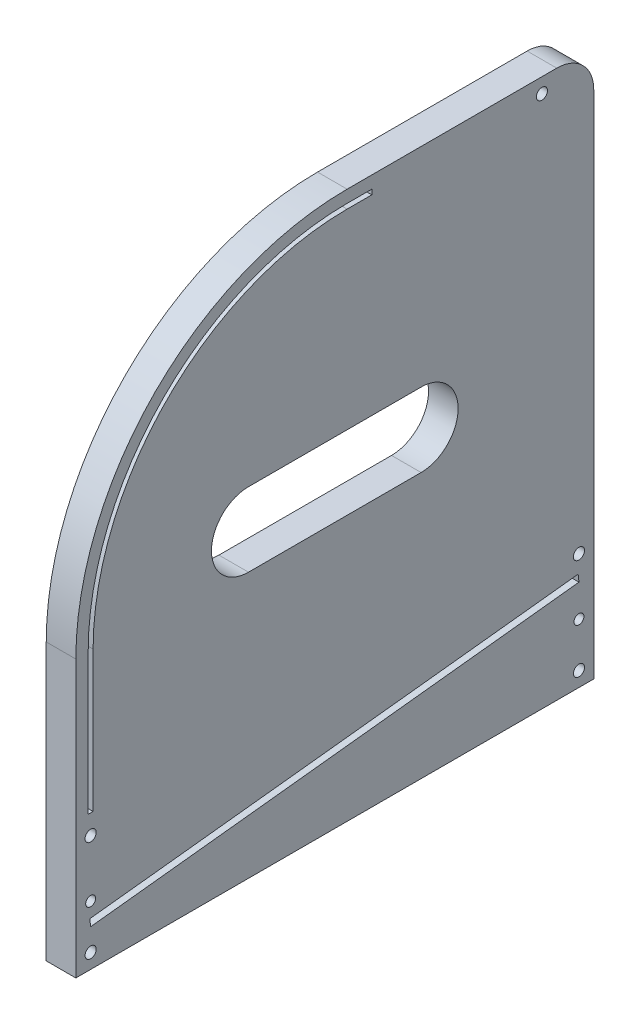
ISO-10303-21;
HEADER;
FILE_DESCRIPTION(('STEP AP214'),'2;1');
FILE_NAME('part.step','',(''),(''),'','','');
FILE_SCHEMA(('AUTOMOTIVE_DESIGN { 1 0 10303 214 1 1 1 1 }'));
ENDSEC;
DATA;
#1=APPLICATION_CONTEXT('core data for automotive mechanical design processes');
#2=APPLICATION_PROTOCOL_DEFINITION('international standard','automotive_design',2000,#1);
#3=PRODUCT_CONTEXT('',#1,'mechanical');
#4=PRODUCT('Part','Part','',(#3));
#5=PRODUCT_RELATED_PRODUCT_CATEGORY('part','',(#4));
#6=PRODUCT_DEFINITION_FORMATION('','',#4);
#7=PRODUCT_DEFINITION_CONTEXT('part definition',#1,'design');
#8=PRODUCT_DEFINITION('design','',#6,#7);
#9=PRODUCT_DEFINITION_SHAPE('','',#8);
#10=(LENGTH_UNIT() NAMED_UNIT(*) SI_UNIT(.MILLI.,.METRE.));
#11=(NAMED_UNIT(*) PLANE_ANGLE_UNIT() SI_UNIT($,.RADIAN.));
#12=(NAMED_UNIT(*) SI_UNIT($,.STERADIAN.) SOLID_ANGLE_UNIT());
#13=UNCERTAINTY_MEASURE_WITH_UNIT(LENGTH_MEASURE(1.E-05),#10,'distance_accuracy_value','');
#14=(GEOMETRIC_REPRESENTATION_CONTEXT(3) GLOBAL_UNCERTAINTY_ASSIGNED_CONTEXT((#13)) GLOBAL_UNIT_ASSIGNED_CONTEXT((#10,
#11,#12)) REPRESENTATION_CONTEXT('',''));
#15=CARTESIAN_POINT('',(0.,0.,0.));
#16=DIRECTION('',(0.,0.,1.));
#17=DIRECTION('',(1.,0.,0.));
#18=AXIS2_PLACEMENT_3D('',#15,#16,#17);
#19=CARTESIAN_POINT('',(-228.,0.,0.));
#20=DIRECTION('',(1.,0.,0.));
#21=DIRECTION('',(0.,0.,-1.));
#22=AXIS2_PLACEMENT_3D('',#19,#20,#21);
#23=PLANE('',#22);
#24=CARTESIAN_POINT('',(-228.,24.,-98.9999999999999));
#25=DIRECTION('',(1.,0.,0.));
#26=DIRECTION('',(0.,0.,-1.));
#27=AXIS2_PLACEMENT_3D('',#24,#25,#26);
#28=CIRCLE('',#27,1.99999999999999);
#29=CARTESIAN_POINT('',(-228.,24.,-101.));
#30=VERTEX_POINT('',#29);
#31=EDGE_CURVE('E819',#30,#30,#28,.T.);
#32=ORIENTED_EDGE('',*,*,#31,.F.);
#33=EDGE_LOOP('',(#32));
#34=FACE_BOUND('',#33,.T.);
#35=CARTESIAN_POINT('',(-228.,24.,99.));
#36=DIRECTION('',(1.,0.,0.));
#37=DIRECTION('',(0.,0.,-1.));
#38=AXIS2_PLACEMENT_3D('',#35,#36,#37);
#39=CIRCLE('',#38,1.99999999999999);
#40=CARTESIAN_POINT('',(-228.,24.,97.));
#41=VERTEX_POINT('',#40);
#42=EDGE_CURVE('E821',#41,#41,#39,.T.);
#43=ORIENTED_EDGE('',*,*,#42,.F.);
#44=EDGE_LOOP('',(#43));
#45=FACE_BOUND('',#44,.T.);
#46=CARTESIAN_POINT('',(-228.,216.,-83.9999999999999));
#47=DIRECTION('',(1.,0.,0.));
#48=DIRECTION('',(0.,0.,-1.));
#49=AXIS2_PLACEMENT_3D('',#46,#47,#48);
#50=CIRCLE('',#49,2.25);
#51=CARTESIAN_POINT('',(-228.,216.,-86.2499999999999));
#52=VERTEX_POINT('',#51);
#53=EDGE_CURVE('E43',#52,#52,#50,.T.);
#54=ORIENTED_EDGE('',*,*,#53,.F.);
#55=EDGE_LOOP('',(#54));
#56=FACE_BOUND('',#55,.T.);
#57=CARTESIAN_POINT('',(-228.,47.,-98.9999999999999));
#58=DIRECTION('',(1.,0.,0.));
#59=DIRECTION('',(0.,0.,-1.));
#60=AXIS2_PLACEMENT_3D('',#57,#58,#59);
#61=CIRCLE('',#60,2.25);
#62=CARTESIAN_POINT('',(-228.,47.,-101.25));
#63=VERTEX_POINT('',#62);
#64=EDGE_CURVE('E374',#63,#63,#61,.T.);
#65=ORIENTED_EDGE('',*,*,#64,.F.);
#66=EDGE_LOOP('',(#65));
#67=FACE_BOUND('',#66,.T.);
#68=CARTESIAN_POINT('',(-228.,6.,-98.9999999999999));
#69=DIRECTION('',(1.,0.,0.));
#70=DIRECTION('',(0.,0.,-1.));
#71=AXIS2_PLACEMENT_3D('',#68,#69,#70);
#72=CIRCLE('',#71,2.25);
#73=CARTESIAN_POINT('',(-228.,6.,-101.25));
#74=VERTEX_POINT('',#73);
#75=EDGE_CURVE('E370',#74,#74,#72,.T.);
#76=ORIENTED_EDGE('',*,*,#75,.F.);
#77=EDGE_LOOP('',(#76));
#78=FACE_BOUND('',#77,.T.);
#79=CARTESIAN_POINT('',(-228.,47.,99.));
#80=DIRECTION('',(1.,0.,0.));
#81=DIRECTION('',(0.,0.,-1.));
#82=AXIS2_PLACEMENT_3D('',#79,#80,#81);
#83=CIRCLE('',#82,2.25);
#84=CARTESIAN_POINT('',(-228.,47.,96.75));
#85=VERTEX_POINT('',#84);
#86=EDGE_CURVE('E365',#85,#85,#83,.T.);
#87=ORIENTED_EDGE('',*,*,#86,.F.);
#88=EDGE_LOOP('',(#87));
#89=FACE_BOUND('',#88,.T.);
#90=CARTESIAN_POINT('',(-228.,6.,99.));
#91=DIRECTION('',(1.,0.,0.));
#92=DIRECTION('',(0.,0.,-1.));
#93=AXIS2_PLACEMENT_3D('',#90,#91,#92);
#94=CIRCLE('',#93,2.25);
#95=CARTESIAN_POINT('',(-228.,6.,96.75));
#96=VERTEX_POINT('',#95);
#97=EDGE_CURVE('E209',#96,#96,#94,.T.);
#98=ORIENTED_EDGE('',*,*,#97,.F.);
#99=EDGE_LOOP('',(#98));
#100=FACE_BOUND('',#99,.T.);
#101=CARTESIAN_POINT('',(-228.,122.5,35.0000000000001));
#102=DIRECTION('',(1.,0.,0.));
#103=DIRECTION('',(0.,0.,-1.));
#104=AXIS2_PLACEMENT_3D('',#101,#102,#103);
#105=CIRCLE('',#104,15.);
#106=CARTESIAN_POINT('',(-228.,137.5,35.0000000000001));
#107=VERTEX_POINT('',#106);
#108=CARTESIAN_POINT('',(-228.,107.5,35.0000000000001));
#109=VERTEX_POINT('',#108);
#110=EDGE_CURVE('E196',#107,#109,#105,.T.);
#111=ORIENTED_EDGE('',*,*,#110,.F.);
#112=DIRECTION('',(0.,0.,1.));
#113=VECTOR('',#112,1.);
#114=CARTESIAN_POINT('',(-228.,137.5,0.));
#115=LINE('',#114,#113);
#116=CARTESIAN_POINT('',(-228.,137.5,-34.9999999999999));
#117=VERTEX_POINT('',#116);
#118=EDGE_CURVE('E229',#117,#107,#115,.T.);
#119=ORIENTED_EDGE('',*,*,#118,.F.);
#120=CARTESIAN_POINT('',(-228.,122.5,-34.9999999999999));
#121=DIRECTION('',(1.,0.,0.));
#122=DIRECTION('',(0.,0.,-1.));
#123=AXIS2_PLACEMENT_3D('',#120,#121,#122);
#124=CIRCLE('',#123,15.);
#125=CARTESIAN_POINT('',(-228.,107.5,-34.9999999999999));
#126=VERTEX_POINT('',#125);
#127=EDGE_CURVE('E227',#126,#117,#124,.T.);
#128=ORIENTED_EDGE('',*,*,#127,.F.);
#129=DIRECTION('',(0.,0.,-1.));
#130=VECTOR('',#129,1.);
#131=CARTESIAN_POINT('',(-228.,107.5,0.));
#132=LINE('',#131,#130);
#133=EDGE_CURVE('E221',#109,#126,#132,.T.);
#134=ORIENTED_EDGE('',*,*,#133,.F.);
#135=EDGE_LOOP('',(#111,#119,#128,#134));
#136=FACE_BOUND('',#135,.T.);
#137=DIRECTION('',(0.,-1.,0.));
#138=VECTOR('',#137,1.);
#139=CARTESIAN_POINT('',(-228.,0.,-105.));
#140=LINE('',#139,#138);
#141=CARTESIAN_POINT('',(-228.,207.,-105.));
#142=VERTEX_POINT('',#141);
#143=CARTESIAN_POINT('',(-228.,0.,-105.));
#144=VERTEX_POINT('',#143);
#145=EDGE_CURVE('E271',#142,#144,#140,.T.);
#146=ORIENTED_EDGE('',*,*,#145,.F.);
#147=CARTESIAN_POINT('',(-228.,207.,-89.9999999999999));
#148=DIRECTION('',(1.,0.,0.));
#149=DIRECTION('',(0.,0.,-1.));
#150=AXIS2_PLACEMENT_3D('',#147,#148,#149);
#151=CIRCLE('',#150,15.);
#152=CARTESIAN_POINT('',(-228.,222.,-89.9999999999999));
#153=VERTEX_POINT('',#152);
#154=EDGE_CURVE('E333',#142,#153,#151,.T.);
#155=ORIENTED_EDGE('',*,*,#154,.T.);
#156=DIRECTION('',(0.,0.,-1.));
#157=VECTOR('',#156,1.);
#158=CARTESIAN_POINT('',(-228.,222.,-105.));
#159=LINE('',#158,#157);
#160=CARTESIAN_POINT('',(-228.,222.,-5.00000000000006));
#161=VERTEX_POINT('',#160);
#162=EDGE_CURVE('E299',#161,#153,#159,.T.);
#163=ORIENTED_EDGE('',*,*,#162,.F.);
#164=CARTESIAN_POINT('',(-228.,112.,-5.00000000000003));
#165=DIRECTION('',(1.,0.,0.));
#166=DIRECTION('',(0.,0.,-1.));
#167=AXIS2_PLACEMENT_3D('',#164,#165,#166);
#168=CIRCLE('',#167,110.);
#169=CARTESIAN_POINT('',(-228.,112.,105.));
#170=VERTEX_POINT('',#169);
#171=EDGE_CURVE('E324',#161,#170,#168,.T.);
#172=ORIENTED_EDGE('',*,*,#171,.T.);
#173=DIRECTION('',(0.,1.,0.));
#174=VECTOR('',#173,1.);
#175=CARTESIAN_POINT('',(-228.,0.,105.));
#176=LINE('',#175,#174);
#177=CARTESIAN_POINT('',(-228.,0.,105.));
#178=VERTEX_POINT('',#177);
#179=EDGE_CURVE('E311',#178,#170,#176,.T.);
#180=ORIENTED_EDGE('',*,*,#179,.F.);
#181=DIRECTION('',(0.,0.,1.));
#182=VECTOR('',#181,1.);
#183=CARTESIAN_POINT('',(-228.,0.,-105.));
#184=LINE('',#183,#182);
#185=EDGE_CURVE('E309',#144,#178,#184,.T.);
#186=ORIENTED_EDGE('',*,*,#185,.F.);
#187=EDGE_LOOP('',(#146,#155,#163,#172,#180,#186));
#188=FACE_BOUND('',#187,.T.);
#189=DIRECTION('',(0.,1.,0.));
#190=VECTOR('',#189,1.);
#191=CARTESIAN_POINT('',(-228.,0.,100.));
#192=LINE('',#191,#190);
#193=CARTESIAN_POINT('',(-228.,55.,100.));
#194=VERTEX_POINT('',#193);
#195=CARTESIAN_POINT('',(-228.,112.,100.));
#196=VERTEX_POINT('',#195);
#197=EDGE_CURVE('E353',#194,#196,#192,.T.);
#198=ORIENTED_EDGE('',*,*,#197,.T.);
#199=CARTESIAN_POINT('',(-228.,112.,-5.00000000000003));
#200=DIRECTION('',(1.,0.,0.));
#201=DIRECTION('',(0.,0.,-1.));
#202=AXIS2_PLACEMENT_3D('',#199,#200,#201);
#203=CIRCLE('',#202,105.);
#204=CARTESIAN_POINT('',(-228.,217.,-5.00000000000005));
#205=VERTEX_POINT('',#204);
#206=EDGE_CURVE('E356',#196,#205,#203,.F.);
#207=ORIENTED_EDGE('',*,*,#206,.T.);
#208=DIRECTION('',(0.,0.,-1.));
#209=VECTOR('',#208,1.);
#210=CARTESIAN_POINT('',(-228.,217.,0.));
#211=LINE('',#210,#209);
#212=CARTESIAN_POINT('',(-228.,217.,-15.));
#213=VERTEX_POINT('',#212);
#214=EDGE_CURVE('E339',#205,#213,#211,.T.);
#215=ORIENTED_EDGE('',*,*,#214,.T.);
#216=DIRECTION('',(0.,1.,0.));
#217=VECTOR('',#216,1.);
#218=CARTESIAN_POINT('',(-228.,0.,-15.));
#219=LINE('',#218,#217);
#220=CARTESIAN_POINT('',(-228.,215.,-15.));
#221=VERTEX_POINT('',#220);
#222=EDGE_CURVE('E342',#221,#213,#219,.T.);
#223=ORIENTED_EDGE('',*,*,#222,.F.);
#224=DIRECTION('',(0.,0.,-1.));
#225=VECTOR('',#224,1.);
#226=CARTESIAN_POINT('',(-228.,215.,0.));
#227=LINE('',#226,#225);
#228=CARTESIAN_POINT('',(-228.,215.,-5.00000000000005));
#229=VERTEX_POINT('',#228);
#230=EDGE_CURVE('E345',#229,#221,#227,.T.);
#231=ORIENTED_EDGE('',*,*,#230,.F.);
#232=CARTESIAN_POINT('',(-228.,112.,-5.00000000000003));
#233=DIRECTION('',(1.,0.,0.));
#234=DIRECTION('',(0.,0.,-1.));
#235=AXIS2_PLACEMENT_3D('',#232,#233,#234);
#236=CIRCLE('',#235,103.);
#237=CARTESIAN_POINT('',(-228.,112.,98.));
#238=VERTEX_POINT('',#237);
#239=EDGE_CURVE('E347',#238,#229,#236,.F.);
#240=ORIENTED_EDGE('',*,*,#239,.F.);
#241=DIRECTION('',(0.,1.,0.));
#242=VECTOR('',#241,1.);
#243=CARTESIAN_POINT('',(-228.,0.,98.));
#244=LINE('',#243,#242);
#245=CARTESIAN_POINT('',(-228.,55.,98.));
#246=VERTEX_POINT('',#245);
#247=EDGE_CURVE('E349',#246,#238,#244,.T.);
#248=ORIENTED_EDGE('',*,*,#247,.F.);
#249=DIRECTION('',(0.,0.,-1.));
#250=VECTOR('',#249,1.);
#251=CARTESIAN_POINT('',(-228.,55.,0.));
#252=LINE('',#251,#250);
#253=EDGE_CURVE('E351',#194,#246,#252,.T.);
#254=ORIENTED_EDGE('',*,*,#253,.F.);
#255=EDGE_LOOP('',(#198,#207,#215,#223,#231,#240,#248,#254));
#256=FACE_BOUND('',#255,.T.);
#257=DIRECTION('',(0.,0.993883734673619,0.110431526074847));
#258=VECTOR('',#257,1.);
#259=CARTESIAN_POINT('',(-228.,11.3170731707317,-101.853658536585));
#260=LINE('',#259,#258);
#261=CARTESIAN_POINT('',(-228.,37.,-98.9999999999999));
#262=VERTEX_POINT('',#261);
#263=CARTESIAN_POINT('',(-228.,39.9816512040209,-98.6687054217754));
#264=VERTEX_POINT('',#263);
#265=EDGE_CURVE('E48',#262,#264,#260,.T.);
#266=ORIENTED_EDGE('',*,*,#265,.F.);
#267=DIRECTION('',(0.,-0.110431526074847,0.993883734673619));
#268=VECTOR('',#267,1.);
#269=CARTESIAN_POINT('',(-228.,25.6829268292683,2.85365853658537));
#270=LINE('',#269,#268);
#271=CARTESIAN_POINT('',(-228.,15.,99.));
#272=VERTEX_POINT('',#271);
#273=EDGE_CURVE('E12',#262,#272,#270,.T.);
#274=ORIENTED_EDGE('',*,*,#273,.T.);
#275=DIRECTION('',(0.,-0.993883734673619,-0.110431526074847));
#276=VECTOR('',#275,1.);
#277=CARTESIAN_POINT('',(-228.,-10.6829268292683,96.1463414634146));
#278=LINE('',#277,#276);
#279=CARTESIAN_POINT('',(-228.,17.9816512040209,99.3312945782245));
#280=VERTEX_POINT('',#279);
#281=EDGE_CURVE('E361',#280,#272,#278,.T.);
#282=ORIENTED_EDGE('',*,*,#281,.F.);
#283=DIRECTION('',(0.,-0.110431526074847,0.993883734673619));
#284=VECTOR('',#283,1.);
#285=CARTESIAN_POINT('',(-228.,28.6645780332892,3.18495311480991));
#286=LINE('',#285,#284);
#287=EDGE_CURVE('E359',#264,#280,#286,.T.);
#288=ORIENTED_EDGE('',*,*,#287,.F.);
#289=EDGE_LOOP('',(#266,#274,#282,#288));
#290=FACE_BOUND('',#289,.T.);
#291=ADVANCED_FACE('F39',(#34,#45,#56,#67,#78,#89,#100,#136,#188,#256,#290),#23,.T.);
#292=CARTESIAN_POINT('',(-240.,0.,-105.));
#293=DIRECTION('',(0.,0.,1.));
#294=DIRECTION('',(1.,0.,0.));
#295=AXIS2_PLACEMENT_3D('',#292,#293,#294);
#296=PLANE('',#295);
#297=DIRECTION('',(0.,-1.,0.));
#298=VECTOR('',#297,1.);
#299=CARTESIAN_POINT('',(-240.,0.,-105.));
#300=LINE('',#299,#298);
#301=CARTESIAN_POINT('',(-240.,207.,-105.));
#302=VERTEX_POINT('',#301);
#303=CARTESIAN_POINT('',(-240.,0.,-105.));
#304=VERTEX_POINT('',#303);
#305=EDGE_CURVE('E296',#302,#304,#300,.T.);
#306=ORIENTED_EDGE('',*,*,#305,.F.);
#307=DIRECTION('',(1.,0.,0.));
#308=VECTOR('',#307,1.);
#309=CARTESIAN_POINT('',(-240.,207.,-105.));
#310=LINE('',#309,#308);
#311=EDGE_CURVE('E330',#302,#142,#310,.T.);
#312=ORIENTED_EDGE('',*,*,#311,.T.);
#313=ORIENTED_EDGE('',*,*,#145,.T.);
#314=DIRECTION('',(1.,0.,0.));
#315=VECTOR('',#314,1.);
#316=CARTESIAN_POINT('',(-240.,0.,-105.));
#317=LINE('',#316,#315);
#318=EDGE_CURVE('E318',#304,#144,#317,.T.);
#319=ORIENTED_EDGE('',*,*,#318,.F.);
#320=EDGE_LOOP('',(#306,#312,#313,#319));
#321=FACE_BOUND('',#320,.T.);
#322=ADVANCED_FACE('F428',(#321),#296,.F.);
#323=CARTESIAN_POINT('',(-240.,0.,-105.));
#324=DIRECTION('',(0.,1.,0.));
#325=DIRECTION('',(0.,0.,1.));
#326=AXIS2_PLACEMENT_3D('',#323,#324,#325);
#327=PLANE('',#326);
#328=ORIENTED_EDGE('',*,*,#185,.T.);
#329=DIRECTION('',(1.,0.,0.));
#330=VECTOR('',#329,1.);
#331=CARTESIAN_POINT('',(-240.,0.,105.));
#332=LINE('',#331,#330);
#333=CARTESIAN_POINT('',(-240.,0.,105.));
#334=VERTEX_POINT('',#333);
#335=EDGE_CURVE('E307',#334,#178,#332,.T.);
#336=ORIENTED_EDGE('',*,*,#335,.F.);
#337=DIRECTION('',(0.,0.,1.));
#338=VECTOR('',#337,1.);
#339=CARTESIAN_POINT('',(-240.,0.,-105.));
#340=LINE('',#339,#338);
#341=EDGE_CURVE('E298',#304,#334,#340,.T.);
#342=ORIENTED_EDGE('',*,*,#341,.F.);
#343=ORIENTED_EDGE('',*,*,#318,.T.);
#344=EDGE_LOOP('',(#328,#336,#342,#343));
#345=FACE_BOUND('',#344,.T.);
#346=ADVANCED_FACE('F434',(#345),#327,.F.);
#347=CARTESIAN_POINT('',(-240.,0.,105.));
#348=DIRECTION('',(0.,0.,-1.));
#349=DIRECTION('',(-1.,0.,0.));
#350=AXIS2_PLACEMENT_3D('',#347,#348,#349);
#351=PLANE('',#350);
#352=ORIENTED_EDGE('',*,*,#179,.T.);
#353=DIRECTION('',(1.,0.,0.));
#354=VECTOR('',#353,1.);
#355=CARTESIAN_POINT('',(-240.,112.,105.));
#356=LINE('',#355,#354);
#357=CARTESIAN_POINT('',(-240.,112.,105.));
#358=VERTEX_POINT('',#357);
#359=EDGE_CURVE('E326',#170,#358,#356,.F.);
#360=ORIENTED_EDGE('',*,*,#359,.T.);
#361=DIRECTION('',(0.,1.,0.));
#362=VECTOR('',#361,1.);
#363=CARTESIAN_POINT('',(-240.,0.,105.));
#364=LINE('',#363,#362);
#365=EDGE_CURVE('E301',#334,#358,#364,.T.);
#366=ORIENTED_EDGE('',*,*,#365,.F.);
#367=ORIENTED_EDGE('',*,*,#335,.T.);
#368=EDGE_LOOP('',(#352,#360,#366,#367));
#369=FACE_BOUND('',#368,.T.);
#370=ADVANCED_FACE('F445',(#369),#351,.F.);
#371=CARTESIAN_POINT('',(-240.,222.,-105.));
#372=DIRECTION('',(0.,-1.,0.));
#373=DIRECTION('',(0.,0.,-1.));
#374=AXIS2_PLACEMENT_3D('',#371,#372,#373);
#375=PLANE('',#374);
#376=ORIENTED_EDGE('',*,*,#162,.T.);
#377=DIRECTION('',(1.,0.,0.));
#378=VECTOR('',#377,1.);
#379=CARTESIAN_POINT('',(-240.,222.,-89.9999999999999));
#380=LINE('',#379,#378);
#381=CARTESIAN_POINT('',(-240.,222.,-89.9999999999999));
#382=VERTEX_POINT('',#381);
#383=EDGE_CURVE('E335',#153,#382,#380,.F.);
#384=ORIENTED_EDGE('',*,*,#383,.T.);
#385=DIRECTION('',(0.,0.,-1.));
#386=VECTOR('',#385,1.);
#387=CARTESIAN_POINT('',(-240.,222.,-105.));
#388=LINE('',#387,#386);
#389=CARTESIAN_POINT('',(-240.,222.,-5.00000000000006));
#390=VERTEX_POINT('',#389);
#391=EDGE_CURVE('E304',#390,#382,#388,.T.);
#392=ORIENTED_EDGE('',*,*,#391,.F.);
#393=DIRECTION('',(1.,0.,0.));
#394=VECTOR('',#393,1.);
#395=CARTESIAN_POINT('',(-240.,222.,-5.00000000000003));
#396=LINE('',#395,#394);
#397=EDGE_CURVE('E321',#390,#161,#396,.T.);
#398=ORIENTED_EDGE('',*,*,#397,.T.);
#399=EDGE_LOOP('',(#376,#384,#392,#398));
#400=FACE_BOUND('',#399,.T.);
#401=ADVANCED_FACE('F442',(#400),#375,.F.);
#402=CARTESIAN_POINT('',(-240.,0.,0.));
#403=DIRECTION('',(1.,0.,0.));
#404=DIRECTION('',(0.,0.,-1.));
#405=AXIS2_PLACEMENT_3D('',#402,#403,#404);
#406=PLANE('',#405);
#407=CARTESIAN_POINT('',(-240.,216.,-83.9999999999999));
#408=DIRECTION('',(-1.,0.,0.));
#409=DIRECTION('',(0.,0.,1.));
#410=AXIS2_PLACEMENT_3D('',#407,#408,#409);
#411=CIRCLE('',#410,4.5);
#412=CARTESIAN_POINT('',(-240.,216.,-79.4999999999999));
#413=VERTEX_POINT('',#412);
#414=EDGE_CURVE('E829',#413,#413,#411,.T.);
#415=ORIENTED_EDGE('',*,*,#414,.F.);
#416=EDGE_LOOP('',(#415));
#417=FACE_BOUND('',#416,.T.);
#418=CARTESIAN_POINT('',(-240.,47.,-98.9999999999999));
#419=DIRECTION('',(-1.,0.,0.));
#420=DIRECTION('',(0.,0.,1.));
#421=AXIS2_PLACEMENT_3D('',#418,#419,#420);
#422=CIRCLE('',#421,4.5);
#423=CARTESIAN_POINT('',(-240.,47.,-94.4999999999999));
#424=VERTEX_POINT('',#423);
#425=EDGE_CURVE('E389',#424,#424,#422,.T.);
#426=ORIENTED_EDGE('',*,*,#425,.F.);
#427=EDGE_LOOP('',(#426));
#428=FACE_BOUND('',#427,.T.);
#429=CARTESIAN_POINT('',(-240.,6.,-98.9999999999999));
#430=DIRECTION('',(-1.,0.,0.));
#431=DIRECTION('',(0.,0.,1.));
#432=AXIS2_PLACEMENT_3D('',#429,#430,#431);
#433=CIRCLE('',#432,4.5);
#434=CARTESIAN_POINT('',(-240.,6.,-94.4999999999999));
#435=VERTEX_POINT('',#434);
#436=EDGE_CURVE('E376',#435,#435,#433,.T.);
#437=ORIENTED_EDGE('',*,*,#436,.F.);
#438=EDGE_LOOP('',(#437));
#439=FACE_BOUND('',#438,.T.);
#440=CARTESIAN_POINT('',(-240.,47.,99.));
#441=DIRECTION('',(-1.,0.,0.));
#442=DIRECTION('',(0.,0.,1.));
#443=AXIS2_PLACEMENT_3D('',#440,#441,#442);
#444=CIRCLE('',#443,4.5);
#445=CARTESIAN_POINT('',(-240.,47.,103.5));
#446=VERTEX_POINT('',#445);
#447=EDGE_CURVE('E372',#446,#446,#444,.T.);
#448=ORIENTED_EDGE('',*,*,#447,.F.);
#449=EDGE_LOOP('',(#448));
#450=FACE_BOUND('',#449,.T.);
#451=CARTESIAN_POINT('',(-240.,6.,99.));
#452=DIRECTION('',(-1.,0.,0.));
#453=DIRECTION('',(0.,0.,1.));
#454=AXIS2_PLACEMENT_3D('',#451,#452,#453);
#455=CIRCLE('',#454,4.5);
#456=CARTESIAN_POINT('',(-240.,6.,103.5));
#457=VERTEX_POINT('',#456);
#458=EDGE_CURVE('E368',#457,#457,#455,.T.);
#459=ORIENTED_EDGE('',*,*,#458,.F.);
#460=EDGE_LOOP('',(#459));
#461=FACE_BOUND('',#460,.T.);
#462=DIRECTION('',(0.,0.,1.));
#463=VECTOR('',#462,1.);
#464=CARTESIAN_POINT('',(-240.,137.5,35.0000000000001));
#465=LINE('',#464,#463);
#466=CARTESIAN_POINT('',(-240.,137.5,-34.9999999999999));
#467=VERTEX_POINT('',#466);
#468=CARTESIAN_POINT('',(-240.,137.5,35.0000000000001));
#469=VERTEX_POINT('',#468);
#470=EDGE_CURVE('E199',#467,#469,#465,.T.);
#471=ORIENTED_EDGE('',*,*,#470,.T.);
#472=CARTESIAN_POINT('',(-240.,122.5,35.0000000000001));
#473=DIRECTION('',(1.,0.,0.));
#474=DIRECTION('',(0.,0.,-1.));
#475=AXIS2_PLACEMENT_3D('',#472,#473,#474);
#476=CIRCLE('',#475,15.);
#477=CARTESIAN_POINT('',(-240.,107.5,35.0000000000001));
#478=VERTEX_POINT('',#477);
#479=EDGE_CURVE('E193',#469,#478,#476,.T.);
#480=ORIENTED_EDGE('',*,*,#479,.T.);
#481=DIRECTION('',(0.,0.,-1.));
#482=VECTOR('',#481,1.);
#483=CARTESIAN_POINT('',(-240.,107.5,35.0000000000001));
#484=LINE('',#483,#482);
#485=CARTESIAN_POINT('',(-240.,107.5,-35.0000000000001));
#486=VERTEX_POINT('',#485);
#487=EDGE_CURVE('E202',#478,#486,#484,.T.);
#488=ORIENTED_EDGE('',*,*,#487,.T.);
#489=CARTESIAN_POINT('',(-240.,122.5,-34.9999999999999));
#490=DIRECTION('',(1.,0.,0.));
#491=DIRECTION('',(0.,0.,-1.));
#492=AXIS2_PLACEMENT_3D('',#489,#490,#491);
#493=CIRCLE('',#492,15.);
#494=EDGE_CURVE('E64',#486,#467,#493,.T.);
#495=ORIENTED_EDGE('',*,*,#494,.T.);
#496=EDGE_LOOP('',(#471,#480,#488,#495));
#497=FACE_BOUND('',#496,.T.);
#498=ORIENTED_EDGE('',*,*,#391,.T.);
#499=CARTESIAN_POINT('',(-240.,207.,-89.9999999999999));
#500=DIRECTION('',(1.,0.,0.));
#501=DIRECTION('',(0.,0.,-1.));
#502=AXIS2_PLACEMENT_3D('',#499,#500,#501);
#503=CIRCLE('',#502,15.);
#504=EDGE_CURVE('E337',#382,#302,#503,.F.);
#505=ORIENTED_EDGE('',*,*,#504,.T.);
#506=ORIENTED_EDGE('',*,*,#305,.T.);
#507=ORIENTED_EDGE('',*,*,#341,.T.);
#508=ORIENTED_EDGE('',*,*,#365,.T.);
#509=CARTESIAN_POINT('',(-240.,112.,-5.00000000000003));
#510=DIRECTION('',(1.,0.,0.));
#511=DIRECTION('',(0.,0.,-1.));
#512=AXIS2_PLACEMENT_3D('',#509,#510,#511);
#513=CIRCLE('',#512,110.);
#514=EDGE_CURVE('E328',#358,#390,#513,.F.);
#515=ORIENTED_EDGE('',*,*,#514,.T.);
#516=EDGE_LOOP('',(#498,#505,#506,#507,#508,#515));
#517=FACE_BOUND('',#516,.T.);
#518=ADVANCED_FACE('F206',(#417,#428,#439,#450,#461,#497,#517),#406,.F.);
#519=CARTESIAN_POINT('',(-240.,112.,-5.00000000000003));
#520=DIRECTION('',(1.,0.,0.));
#521=DIRECTION('',(0.,0.,-1.));
#522=AXIS2_PLACEMENT_3D('',#519,#520,#521);
#523=CYLINDRICAL_SURFACE('',#522,110.);
#524=ORIENTED_EDGE('',*,*,#514,.F.);
#525=ORIENTED_EDGE('',*,*,#359,.F.);
#526=ORIENTED_EDGE('',*,*,#171,.F.);
#527=ORIENTED_EDGE('',*,*,#397,.F.);
#528=EDGE_LOOP('',(#524,#525,#526,#527));
#529=FACE_BOUND('',#528,.T.);
#530=ADVANCED_FACE('F452',(#529),#523,.T.);
#531=CARTESIAN_POINT('',(-240.,207.,-89.9999999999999));
#532=DIRECTION('',(1.,0.,0.));
#533=DIRECTION('',(0.,0.,-1.));
#534=AXIS2_PLACEMENT_3D('',#531,#532,#533);
#535=CYLINDRICAL_SURFACE('',#534,15.);
#536=ORIENTED_EDGE('',*,*,#504,.F.);
#537=ORIENTED_EDGE('',*,*,#383,.F.);
#538=ORIENTED_EDGE('',*,*,#154,.F.);
#539=ORIENTED_EDGE('',*,*,#311,.F.);
#540=EDGE_LOOP('',(#536,#537,#538,#539));
#541=FACE_BOUND('',#540,.T.);
#542=ADVANCED_FACE('F41',(#541),#535,.T.);
#543=CARTESIAN_POINT('',(-438.668064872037,112.,-5.00000000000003));
#544=DIRECTION('',(1.,0.,0.));
#545=DIRECTION('',(0.,0.,-1.));
#546=AXIS2_PLACEMENT_3D('',#543,#544,#545);
#547=CYLINDRICAL_SURFACE('',#546,105.);
#548=DIRECTION('',(1.,0.,0.));
#549=VECTOR('',#548,1.);
#550=CARTESIAN_POINT('',(-438.668064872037,112.,100.));
#551=LINE('',#550,#549);
#552=CARTESIAN_POINT('',(-231.,112.,100.));
#553=VERTEX_POINT('',#552);
#554=EDGE_CURVE('E274',#553,#196,#551,.T.);
#555=ORIENTED_EDGE('',*,*,#554,.F.);
#556=CARTESIAN_POINT('',(-231.,112.,-5.00000000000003));
#557=DIRECTION('',(1.,0.,0.));
#558=DIRECTION('',(0.,0.,-1.));
#559=AXIS2_PLACEMENT_3D('',#556,#557,#558);
#560=CIRCLE('',#559,105.);
#561=CARTESIAN_POINT('',(-231.,217.,-5.00000000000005));
#562=VERTEX_POINT('',#561);
#563=EDGE_CURVE('E258',#562,#553,#560,.T.);
#564=ORIENTED_EDGE('',*,*,#563,.F.);
#565=DIRECTION('',(1.,0.,0.));
#566=VECTOR('',#565,1.);
#567=CARTESIAN_POINT('',(-438.668064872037,217.,-5.00000000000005));
#568=LINE('',#567,#566);
#569=EDGE_CURVE('E251',#562,#205,#568,.T.);
#570=ORIENTED_EDGE('',*,*,#569,.T.);
#571=ORIENTED_EDGE('',*,*,#206,.F.);
#572=EDGE_LOOP('',(#555,#564,#570,#571));
#573=FACE_BOUND('',#572,.T.);
#574=ADVANCED_FACE('F459',(#573),#547,.F.);
#575=CARTESIAN_POINT('',(-438.668064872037,55.,100.));
#576=DIRECTION('',(0.,0.,-1.));
#577=DIRECTION('',(-1.,0.,0.));
#578=AXIS2_PLACEMENT_3D('',#575,#576,#577);
#579=PLANE('',#578);
#580=DIRECTION('',(1.,0.,0.));
#581=VECTOR('',#580,1.);
#582=CARTESIAN_POINT('',(-438.668064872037,55.,100.));
#583=LINE('',#582,#581);
#584=CARTESIAN_POINT('',(-231.,55.,100.));
#585=VERTEX_POINT('',#584);
#586=EDGE_CURVE('E277',#585,#194,#583,.T.);
#587=ORIENTED_EDGE('',*,*,#586,.F.);
#588=DIRECTION('',(0.,-1.,0.));
#589=VECTOR('',#588,1.);
#590=CARTESIAN_POINT('',(-231.,55.,100.));
#591=LINE('',#590,#589);
#592=EDGE_CURVE('E254',#553,#585,#591,.T.);
#593=ORIENTED_EDGE('',*,*,#592,.F.);
#594=ORIENTED_EDGE('',*,*,#554,.T.);
#595=ORIENTED_EDGE('',*,*,#197,.F.);
#596=EDGE_LOOP('',(#587,#593,#594,#595));
#597=FACE_BOUND('',#596,.T.);
#598=ADVANCED_FACE('F520',(#597),#579,.T.);
#599=CARTESIAN_POINT('',(-438.668064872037,55.,100.));
#600=DIRECTION('',(0.,-1.,0.));
#601=DIRECTION('',(0.,0.,-1.));
#602=AXIS2_PLACEMENT_3D('',#599,#600,#601);
#603=PLANE('',#602);
#604=ORIENTED_EDGE('',*,*,#253,.T.);
#605=DIRECTION('',(1.,0.,0.));
#606=VECTOR('',#605,1.);
#607=CARTESIAN_POINT('',(-438.668064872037,55.,98.));
#608=LINE('',#607,#606);
#609=CARTESIAN_POINT('',(-231.,55.,98.));
#610=VERTEX_POINT('',#609);
#611=EDGE_CURVE('E280',#610,#246,#608,.T.);
#612=ORIENTED_EDGE('',*,*,#611,.F.);
#613=DIRECTION('',(0.,0.,1.));
#614=VECTOR('',#613,1.);
#615=CARTESIAN_POINT('',(-231.,55.,100.));
#616=LINE('',#615,#614);
#617=EDGE_CURVE('E257',#610,#585,#616,.T.);
#618=ORIENTED_EDGE('',*,*,#617,.T.);
#619=ORIENTED_EDGE('',*,*,#586,.T.);
#620=EDGE_LOOP('',(#604,#612,#618,#619));
#621=FACE_BOUND('',#620,.T.);
#622=ADVANCED_FACE('F524',(#621),#603,.F.);
#623=CARTESIAN_POINT('',(-438.668064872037,55.,98.));
#624=DIRECTION('',(0.,0.,-1.));
#625=DIRECTION('',(-1.,0.,0.));
#626=AXIS2_PLACEMENT_3D('',#623,#624,#625);
#627=PLANE('',#626);
#628=ORIENTED_EDGE('',*,*,#247,.T.);
#629=DIRECTION('',(1.,0.,0.));
#630=VECTOR('',#629,1.);
#631=CARTESIAN_POINT('',(-438.668064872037,112.,98.));
#632=LINE('',#631,#630);
#633=CARTESIAN_POINT('',(-231.,112.,98.));
#634=VERTEX_POINT('',#633);
#635=EDGE_CURVE('E283',#634,#238,#632,.T.);
#636=ORIENTED_EDGE('',*,*,#635,.F.);
#637=DIRECTION('',(0.,-1.,0.));
#638=VECTOR('',#637,1.);
#639=CARTESIAN_POINT('',(-231.,55.,98.));
#640=LINE('',#639,#638);
#641=EDGE_CURVE('E260',#634,#610,#640,.T.);
#642=ORIENTED_EDGE('',*,*,#641,.T.);
#643=ORIENTED_EDGE('',*,*,#611,.T.);
#644=EDGE_LOOP('',(#628,#636,#642,#643));
#645=FACE_BOUND('',#644,.T.);
#646=ADVANCED_FACE('F528',(#645),#627,.F.);
#647=CARTESIAN_POINT('',(-438.668064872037,112.,-5.00000000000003));
#648=DIRECTION('',(1.,0.,0.));
#649=DIRECTION('',(0.,0.,-1.));
#650=AXIS2_PLACEMENT_3D('',#647,#648,#649);
#651=CYLINDRICAL_SURFACE('',#650,103.);
#652=ORIENTED_EDGE('',*,*,#239,.T.);
#653=DIRECTION('',(1.,0.,0.));
#654=VECTOR('',#653,1.);
#655=CARTESIAN_POINT('',(-438.668064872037,215.,-5.00000000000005));
#656=LINE('',#655,#654);
#657=CARTESIAN_POINT('',(-231.,215.,-5.00000000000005));
#658=VERTEX_POINT('',#657);
#659=EDGE_CURVE('E286',#658,#229,#656,.T.);
#660=ORIENTED_EDGE('',*,*,#659,.F.);
#661=CARTESIAN_POINT('',(-231.,112.,-5.00000000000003));
#662=DIRECTION('',(1.,0.,0.));
#663=DIRECTION('',(0.,0.,-1.));
#664=AXIS2_PLACEMENT_3D('',#661,#662,#663);
#665=CIRCLE('',#664,103.);
#666=EDGE_CURVE('E262',#658,#634,#665,.T.);
#667=ORIENTED_EDGE('',*,*,#666,.T.);
#668=ORIENTED_EDGE('',*,*,#635,.T.);
#669=EDGE_LOOP('',(#652,#660,#667,#668));
#670=FACE_BOUND('',#669,.T.);
#671=ADVANCED_FACE('F532',(#670),#651,.T.);
#672=CARTESIAN_POINT('',(-438.668064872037,215.,-5.00000000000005));
#673=DIRECTION('',(0.,-1.,0.));
#674=DIRECTION('',(0.,0.,-1.));
#675=AXIS2_PLACEMENT_3D('',#672,#673,#674);
#676=PLANE('',#675);
#677=ORIENTED_EDGE('',*,*,#230,.T.);
#678=DIRECTION('',(1.,0.,0.));
#679=VECTOR('',#678,1.);
#680=CARTESIAN_POINT('',(-438.668064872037,215.,-15.));
#681=LINE('',#680,#679);
#682=CARTESIAN_POINT('',(-231.,215.,-15.));
#683=VERTEX_POINT('',#682);
#684=EDGE_CURVE('E289',#683,#221,#681,.T.);
#685=ORIENTED_EDGE('',*,*,#684,.F.);
#686=DIRECTION('',(0.,0.,1.));
#687=VECTOR('',#686,1.);
#688=CARTESIAN_POINT('',(-231.,215.,-5.00000000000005));
#689=LINE('',#688,#687);
#690=EDGE_CURVE('E264',#683,#658,#689,.T.);
#691=ORIENTED_EDGE('',*,*,#690,.T.);
#692=ORIENTED_EDGE('',*,*,#659,.T.);
#693=EDGE_LOOP('',(#677,#685,#691,#692));
#694=FACE_BOUND('',#693,.T.);
#695=ADVANCED_FACE('F536',(#694),#676,.F.);
#696=CARTESIAN_POINT('',(-438.668064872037,215.,-15.));
#697=DIRECTION('',(0.,0.,-1.));
#698=DIRECTION('',(-1.,0.,0.));
#699=AXIS2_PLACEMENT_3D('',#696,#697,#698);
#700=PLANE('',#699);
#701=ORIENTED_EDGE('',*,*,#222,.T.);
#702=DIRECTION('',(1.,0.,0.));
#703=VECTOR('',#702,1.);
#704=CARTESIAN_POINT('',(-438.668064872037,217.,-15.));
#705=LINE('',#704,#703);
#706=CARTESIAN_POINT('',(-231.,217.,-15.));
#707=VERTEX_POINT('',#706);
#708=EDGE_CURVE('E292',#707,#213,#705,.T.);
#709=ORIENTED_EDGE('',*,*,#708,.F.);
#710=DIRECTION('',(0.,-1.,0.));
#711=VECTOR('',#710,1.);
#712=CARTESIAN_POINT('',(-231.,215.,-15.));
#713=LINE('',#712,#711);
#714=EDGE_CURVE('E266',#707,#683,#713,.T.);
#715=ORIENTED_EDGE('',*,*,#714,.T.);
#716=ORIENTED_EDGE('',*,*,#684,.T.);
#717=EDGE_LOOP('',(#701,#709,#715,#716));
#718=FACE_BOUND('',#717,.T.);
#719=ADVANCED_FACE('F540',(#718),#700,.F.);
#720=CARTESIAN_POINT('',(-438.668064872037,217.,-5.00000000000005));
#721=DIRECTION('',(0.,-1.,0.));
#722=DIRECTION('',(0.,0.,-1.));
#723=AXIS2_PLACEMENT_3D('',#720,#721,#722);
#724=PLANE('',#723);
#725=ORIENTED_EDGE('',*,*,#569,.F.);
#726=DIRECTION('',(0.,0.,1.));
#727=VECTOR('',#726,1.);
#728=CARTESIAN_POINT('',(-231.,217.,-5.00000000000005));
#729=LINE('',#728,#727);
#730=EDGE_CURVE('E268',#707,#562,#729,.T.);
#731=ORIENTED_EDGE('',*,*,#730,.F.);
#732=ORIENTED_EDGE('',*,*,#708,.T.);
#733=ORIENTED_EDGE('',*,*,#214,.F.);
#734=EDGE_LOOP('',(#725,#731,#732,#733));
#735=FACE_BOUND('',#734,.T.);
#736=ADVANCED_FACE('F516',(#735),#724,.T.);
#737=CARTESIAN_POINT('',(-231.,0.,0.));
#738=DIRECTION('',(1.,0.,0.));
#739=DIRECTION('',(0.,0.,-1.));
#740=AXIS2_PLACEMENT_3D('',#737,#738,#739);
#741=PLANE('',#740);
#742=ORIENTED_EDGE('',*,*,#714,.F.);
#743=ORIENTED_EDGE('',*,*,#730,.T.);
#744=ORIENTED_EDGE('',*,*,#563,.T.);
#745=ORIENTED_EDGE('',*,*,#592,.T.);
#746=ORIENTED_EDGE('',*,*,#617,.F.);
#747=ORIENTED_EDGE('',*,*,#641,.F.);
#748=ORIENTED_EDGE('',*,*,#666,.F.);
#749=ORIENTED_EDGE('',*,*,#690,.F.);
#750=EDGE_LOOP('',(#742,#743,#744,#745,#746,#747,#748,#749));
#751=FACE_BOUND('',#750,.T.);
#752=ADVANCED_FACE('F513',(#751),#741,.T.);
#753=CARTESIAN_POINT('',(51.,37.,-98.9999999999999));
#754=DIRECTION('',(0.,0.110431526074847,-0.993883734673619));
#755=DIRECTION('',(0.,0.993883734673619,0.110431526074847));
#756=AXIS2_PLACEMENT_3D('',#753,#754,#755);
#757=PLANE('',#756);
#758=ORIENTED_EDGE('',*,*,#265,.T.);
#759=DIRECTION('',(-1.,0.,0.));
#760=VECTOR('',#759,1.);
#761=CARTESIAN_POINT('',(51.,39.9816512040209,-98.6687054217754));
#762=LINE('',#761,#760);
#763=CARTESIAN_POINT('',(-231.,39.9816512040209,-98.6687054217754));
#764=VERTEX_POINT('',#763);
#765=EDGE_CURVE('E232',#264,#764,#762,.T.);
#766=ORIENTED_EDGE('',*,*,#765,.T.);
#767=DIRECTION('',(0.,0.993883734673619,0.110431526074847));
#768=VECTOR('',#767,1.);
#769=CARTESIAN_POINT('',(-231.,37.,-98.9999999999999));
#770=LINE('',#769,#768);
#771=CARTESIAN_POINT('',(-231.,37.,-98.9999999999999));
#772=VERTEX_POINT('',#771);
#773=EDGE_CURVE('E242',#772,#764,#770,.T.);
#774=ORIENTED_EDGE('',*,*,#773,.F.);
#775=DIRECTION('',(-1.,0.,0.));
#776=VECTOR('',#775,1.);
#777=CARTESIAN_POINT('',(51.,37.,-98.9999999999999));
#778=LINE('',#777,#776);
#779=EDGE_CURVE('E233',#262,#772,#778,.T.);
#780=ORIENTED_EDGE('',*,*,#779,.F.);
#781=EDGE_LOOP('',(#758,#766,#774,#780));
#782=FACE_BOUND('',#781,.T.);
#783=ADVANCED_FACE('F487',(#782),#757,.F.);
#784=CARTESIAN_POINT('',(-231.,15.,99.));
#785=DIRECTION('',(0.,-0.110431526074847,0.993883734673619));
#786=DIRECTION('',(0.,-0.993883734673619,-0.110431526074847));
#787=AXIS2_PLACEMENT_3D('',#784,#785,#786);
#788=PLANE('',#787);
#789=ORIENTED_EDGE('',*,*,#281,.T.);
#790=DIRECTION('',(1.,0.,0.));
#791=VECTOR('',#790,1.);
#792=CARTESIAN_POINT('',(-231.,15.,99.));
#793=LINE('',#792,#791);
#794=CARTESIAN_POINT('',(-231.,15.,99.));
#795=VERTEX_POINT('',#794);
#796=EDGE_CURVE('E239',#795,#272,#793,.T.);
#797=ORIENTED_EDGE('',*,*,#796,.F.);
#798=DIRECTION('',(0.,0.993883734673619,0.110431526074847));
#799=VECTOR('',#798,1.);
#800=CARTESIAN_POINT('',(-231.,15.,99.));
#801=LINE('',#800,#799);
#802=CARTESIAN_POINT('',(-231.,17.9816512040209,99.3312945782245));
#803=VERTEX_POINT('',#802);
#804=EDGE_CURVE('E249',#795,#803,#801,.T.);
#805=ORIENTED_EDGE('',*,*,#804,.T.);
#806=DIRECTION('',(1.,0.,0.));
#807=VECTOR('',#806,1.);
#808=CARTESIAN_POINT('',(-231.,17.9816512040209,99.3312945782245));
#809=LINE('',#808,#807);
#810=EDGE_CURVE('E236',#803,#280,#809,.T.);
#811=ORIENTED_EDGE('',*,*,#810,.T.);
#812=EDGE_LOOP('',(#789,#797,#805,#811));
#813=FACE_BOUND('',#812,.T.);
#814=ADVANCED_FACE('F494',(#813),#788,.F.);
#815=CARTESIAN_POINT('',(-231.,37.,-98.9999999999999));
#816=DIRECTION('',(-1.,0.,0.));
#817=DIRECTION('',(0.,0.,1.));
#818=AXIS2_PLACEMENT_3D('',#815,#816,#817);
#819=PLANE('',#818);
#820=DIRECTION('',(0.,-0.110431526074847,0.993883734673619));
#821=VECTOR('',#820,1.);
#822=CARTESIAN_POINT('',(-231.,39.9816512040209,-98.6687054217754));
#823=LINE('',#822,#821);
#824=EDGE_CURVE('E244',#764,#803,#823,.T.);
#825=ORIENTED_EDGE('',*,*,#824,.T.);
#826=ORIENTED_EDGE('',*,*,#804,.F.);
#827=DIRECTION('',(0.,-0.110431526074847,0.993883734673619));
#828=VECTOR('',#827,1.);
#829=CARTESIAN_POINT('',(-231.,37.,-98.9999999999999));
#830=LINE('',#829,#828);
#831=EDGE_CURVE('E235',#772,#795,#830,.T.);
#832=ORIENTED_EDGE('',*,*,#831,.F.);
#833=ORIENTED_EDGE('',*,*,#773,.T.);
#834=EDGE_LOOP('',(#825,#826,#832,#833));
#835=FACE_BOUND('',#834,.T.);
#836=ADVANCED_FACE('F500',(#835),#819,.F.);
#837=CARTESIAN_POINT('',(0.,25.6829268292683,2.85365853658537));
#838=DIRECTION('',(0.,0.993883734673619,0.110431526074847));
#839=DIRECTION('',(0.,-0.110431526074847,0.993883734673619));
#840=AXIS2_PLACEMENT_3D('',#837,#838,#839);
#841=PLANE('',#840);
#842=ORIENTED_EDGE('',*,*,#779,.T.);
#843=ORIENTED_EDGE('',*,*,#831,.T.);
#844=ORIENTED_EDGE('',*,*,#796,.T.);
#845=ORIENTED_EDGE('',*,*,#273,.F.);
#846=EDGE_LOOP('',(#842,#843,#844,#845));
#847=FACE_BOUND('',#846,.T.);
#848=ADVANCED_FACE('F491',(#847),#841,.T.);
#849=CARTESIAN_POINT('',(0.,28.6645780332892,3.18495311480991));
#850=DIRECTION('',(0.,0.993883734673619,0.110431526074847));
#851=DIRECTION('',(0.,-0.110431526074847,0.993883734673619));
#852=AXIS2_PLACEMENT_3D('',#849,#850,#851);
#853=PLANE('',#852);
#854=ORIENTED_EDGE('',*,*,#287,.T.);
#855=ORIENTED_EDGE('',*,*,#810,.F.);
#856=ORIENTED_EDGE('',*,*,#824,.F.);
#857=ORIENTED_EDGE('',*,*,#765,.F.);
#858=EDGE_LOOP('',(#854,#855,#856,#857));
#859=FACE_BOUND('',#858,.T.);
#860=ADVANCED_FACE('F498',(#859),#853,.F.);
#861=CARTESIAN_POINT('',(-240.,122.5,35.0000000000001));
#862=DIRECTION('',(1.,0.,0.));
#863=DIRECTION('',(0.,0.,-1.));
#864=AXIS2_PLACEMENT_3D('',#861,#862,#863);
#865=CYLINDRICAL_SURFACE('',#864,15.);
#866=ORIENTED_EDGE('',*,*,#110,.T.);
#867=DIRECTION('',(1.,0.,0.));
#868=VECTOR('',#867,1.);
#869=CARTESIAN_POINT('',(-240.,107.5,35.0000000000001));
#870=LINE('',#869,#868);
#871=EDGE_CURVE('E56',#478,#109,#870,.T.);
#872=ORIENTED_EDGE('',*,*,#871,.F.);
#873=ORIENTED_EDGE('',*,*,#479,.F.);
#874=DIRECTION('',(1.,0.,0.));
#875=VECTOR('',#874,1.);
#876=CARTESIAN_POINT('',(-240.,137.5,35.0000000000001));
#877=LINE('',#876,#875);
#878=EDGE_CURVE('E219',#469,#107,#877,.T.);
#879=ORIENTED_EDGE('',*,*,#878,.T.);
#880=EDGE_LOOP('',(#866,#872,#873,#879));
#881=FACE_BOUND('',#880,.T.);
#882=ADVANCED_FACE('F190',(#881),#865,.F.);
#883=CARTESIAN_POINT('',(-240.,137.5,35.0000000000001));
#884=DIRECTION('',(0.,1.,0.));
#885=DIRECTION('',(0.,0.,1.));
#886=AXIS2_PLACEMENT_3D('',#883,#884,#885);
#887=PLANE('',#886);
#888=ORIENTED_EDGE('',*,*,#118,.T.);
#889=ORIENTED_EDGE('',*,*,#878,.F.);
#890=ORIENTED_EDGE('',*,*,#470,.F.);
#891=DIRECTION('',(1.,0.,0.));
#892=VECTOR('',#891,1.);
#893=CARTESIAN_POINT('',(-240.,137.5,-34.9999999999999));
#894=LINE('',#893,#892);
#895=EDGE_CURVE('E222',#467,#117,#894,.T.);
#896=ORIENTED_EDGE('',*,*,#895,.T.);
#897=EDGE_LOOP('',(#888,#889,#890,#896));
#898=FACE_BOUND('',#897,.T.);
#899=ADVANCED_FACE('F611',(#898),#887,.F.);
#900=CARTESIAN_POINT('',(-240.,122.5,-34.9999999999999));
#901=DIRECTION('',(1.,0.,0.));
#902=DIRECTION('',(0.,0.,-1.));
#903=AXIS2_PLACEMENT_3D('',#900,#901,#902);
#904=CYLINDRICAL_SURFACE('',#903,15.);
#905=ORIENTED_EDGE('',*,*,#127,.T.);
#906=ORIENTED_EDGE('',*,*,#895,.F.);
#907=ORIENTED_EDGE('',*,*,#494,.F.);
#908=DIRECTION('',(1.,0.,0.));
#909=VECTOR('',#908,1.);
#910=CARTESIAN_POINT('',(-240.,107.5,-34.9999999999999));
#911=LINE('',#910,#909);
#912=EDGE_CURVE('E198',#486,#126,#911,.T.);
#913=ORIENTED_EDGE('',*,*,#912,.T.);
#914=EDGE_LOOP('',(#905,#906,#907,#913));
#915=FACE_BOUND('',#914,.T.);
#916=ADVANCED_FACE('F620',(#915),#904,.F.);
#917=CARTESIAN_POINT('',(-240.,107.5,35.0000000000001));
#918=DIRECTION('',(0.,-1.,0.));
#919=DIRECTION('',(0.,0.,-1.));
#920=AXIS2_PLACEMENT_3D('',#917,#918,#919);
#921=PLANE('',#920);
#922=ORIENTED_EDGE('',*,*,#133,.T.);
#923=ORIENTED_EDGE('',*,*,#912,.F.);
#924=ORIENTED_EDGE('',*,*,#487,.F.);
#925=ORIENTED_EDGE('',*,*,#871,.T.);
#926=EDGE_LOOP('',(#922,#923,#924,#925));
#927=FACE_BOUND('',#926,.T.);
#928=ADVANCED_FACE('F203',(#927),#921,.F.);
#929=CARTESIAN_POINT('',(-240.,6.,99.));
#930=DIRECTION('',(-1.,0.,0.));
#931=DIRECTION('',(0.,0.,1.));
#932=AXIS2_PLACEMENT_3D('',#929,#930,#931);
#933=CYLINDRICAL_SURFACE('',#932,2.25);
#934=ORIENTED_EDGE('',*,*,#97,.T.);
#935=EDGE_LOOP('',(#934));
#936=FACE_BOUND('',#935,.T.);
#937=CARTESIAN_POINT('',(-236.9,6.,99.));
#938=DIRECTION('',(-1.,0.,0.));
#939=DIRECTION('',(0.,0.,1.));
#940=AXIS2_PLACEMENT_3D('',#937,#938,#939);
#941=CIRCLE('',#940,2.25);
#942=CARTESIAN_POINT('',(-236.9,6.,101.25));
#943=VERTEX_POINT('',#942);
#944=EDGE_CURVE('E212',#943,#943,#941,.T.);
#945=ORIENTED_EDGE('',*,*,#944,.T.);
#946=EDGE_LOOP('',(#945));
#947=FACE_BOUND('',#946,.T.);
#948=ADVANCED_FACE('F412',(#936,#947),#933,.F.);
#949=CARTESIAN_POINT('',(-236.9,8.25,99.));
#950=DIRECTION('',(1.,0.,0.));
#951=DIRECTION('',(0.,0.,-1.));
#952=AXIS2_PLACEMENT_3D('',#949,#950,#951);
#953=PLANE('',#952);
#954=ORIENTED_EDGE('',*,*,#944,.F.);
#955=EDGE_LOOP('',(#954));
#956=FACE_BOUND('',#955,.T.);
#957=CARTESIAN_POINT('',(-236.9,6.,99.));
#958=DIRECTION('',(-1.,0.,0.));
#959=DIRECTION('',(0.,0.,1.));
#960=AXIS2_PLACEMENT_3D('',#957,#958,#959);
#961=CIRCLE('',#960,4.5);
#962=CARTESIAN_POINT('',(-236.9,6.,103.5));
#963=VERTEX_POINT('',#962);
#964=EDGE_CURVE('E405',#963,#963,#961,.T.);
#965=ORIENTED_EDGE('',*,*,#964,.T.);
#966=EDGE_LOOP('',(#965));
#967=FACE_BOUND('',#966,.T.);
#968=ADVANCED_FACE('F414',(#956,#967),#953,.F.);
#969=CARTESIAN_POINT('',(-240.,6.,99.));
#970=DIRECTION('',(-1.,0.,0.));
#971=DIRECTION('',(0.,0.,1.));
#972=AXIS2_PLACEMENT_3D('',#969,#970,#971);
#973=CYLINDRICAL_SURFACE('',#972,4.5);
#974=ORIENTED_EDGE('',*,*,#964,.F.);
#975=EDGE_LOOP('',(#974));
#976=FACE_BOUND('',#975,.T.);
#977=ORIENTED_EDGE('',*,*,#458,.T.);
#978=EDGE_LOOP('',(#977));
#979=FACE_BOUND('',#978,.T.);
#980=ADVANCED_FACE('F416',(#976,#979),#973,.F.);
#981=CARTESIAN_POINT('',(-240.,47.,99.));
#982=DIRECTION('',(-1.,0.,0.));
#983=DIRECTION('',(0.,0.,1.));
#984=AXIS2_PLACEMENT_3D('',#981,#982,#983);
#985=CYLINDRICAL_SURFACE('',#984,2.25);
#986=ORIENTED_EDGE('',*,*,#86,.T.);
#987=EDGE_LOOP('',(#986));
#988=FACE_BOUND('',#987,.T.);
#989=CARTESIAN_POINT('',(-236.9,47.,99.));
#990=DIRECTION('',(-1.,0.,0.));
#991=DIRECTION('',(0.,0.,1.));
#992=AXIS2_PLACEMENT_3D('',#989,#990,#991);
#993=CIRCLE('',#992,2.25);
#994=CARTESIAN_POINT('',(-236.9,47.,101.25));
#995=VERTEX_POINT('',#994);
#996=EDGE_CURVE('E369',#995,#995,#993,.T.);
#997=ORIENTED_EDGE('',*,*,#996,.T.);
#998=EDGE_LOOP('',(#997));
#999=FACE_BOUND('',#998,.T.);
#1000=ADVANCED_FACE('F422',(#988,#999),#985,.F.);
#1001=CARTESIAN_POINT('',(-236.9,49.25,99.));
#1002=DIRECTION('',(1.,0.,0.));
#1003=DIRECTION('',(0.,0.,-1.));
#1004=AXIS2_PLACEMENT_3D('',#1001,#1002,#1003);
#1005=PLANE('',#1004);
#1006=ORIENTED_EDGE('',*,*,#996,.F.);
#1007=EDGE_LOOP('',(#1006));
#1008=FACE_BOUND('',#1007,.T.);
#1009=CARTESIAN_POINT('',(-236.9,47.,99.));
#1010=DIRECTION('',(-1.,0.,0.));
#1011=DIRECTION('',(0.,0.,1.));
#1012=AXIS2_PLACEMENT_3D('',#1009,#1010,#1011);
#1013=CIRCLE('',#1012,4.5);
#1014=CARTESIAN_POINT('',(-236.9,47.,103.5));
#1015=VERTEX_POINT('',#1014);
#1016=EDGE_CURVE('E399',#1015,#1015,#1013,.T.);
#1017=ORIENTED_EDGE('',*,*,#1016,.T.);
#1018=EDGE_LOOP('',(#1017));
#1019=FACE_BOUND('',#1018,.T.);
#1020=ADVANCED_FACE('F661',(#1008,#1019),#1005,.F.);
#1021=CARTESIAN_POINT('',(-240.,47.,99.));
#1022=DIRECTION('',(-1.,0.,0.));
#1023=DIRECTION('',(0.,0.,1.));
#1024=AXIS2_PLACEMENT_3D('',#1021,#1022,#1023);
#1025=CYLINDRICAL_SURFACE('',#1024,4.5);
#1026=ORIENTED_EDGE('',*,*,#1016,.F.);
#1027=EDGE_LOOP('',(#1026));
#1028=FACE_BOUND('',#1027,.T.);
#1029=ORIENTED_EDGE('',*,*,#447,.T.);
#1030=EDGE_LOOP('',(#1029));
#1031=FACE_BOUND('',#1030,.T.);
#1032=ADVANCED_FACE('F670',(#1028,#1031),#1025,.F.);
#1033=CARTESIAN_POINT('',(-240.,6.,-98.9999999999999));
#1034=DIRECTION('',(-1.,0.,0.));
#1035=DIRECTION('',(0.,0.,1.));
#1036=AXIS2_PLACEMENT_3D('',#1033,#1034,#1035);
#1037=CYLINDRICAL_SURFACE('',#1036,2.25);
#1038=ORIENTED_EDGE('',*,*,#75,.T.);
#1039=EDGE_LOOP('',(#1038));
#1040=FACE_BOUND('',#1039,.T.);
#1041=CARTESIAN_POINT('',(-236.9,6.,-98.9999999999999));
#1042=DIRECTION('',(-1.,0.,0.));
#1043=DIRECTION('',(0.,0.,1.));
#1044=AXIS2_PLACEMENT_3D('',#1041,#1042,#1043);
#1045=CIRCLE('',#1044,2.25);
#1046=CARTESIAN_POINT('',(-236.9,6.,-96.7499999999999));
#1047=VERTEX_POINT('',#1046);
#1048=EDGE_CURVE('E373',#1047,#1047,#1045,.T.);
#1049=ORIENTED_EDGE('',*,*,#1048,.T.);
#1050=EDGE_LOOP('',(#1049));
#1051=FACE_BOUND('',#1050,.T.);
#1052=ADVANCED_FACE('F679',(#1040,#1051),#1037,.F.);
#1053=CARTESIAN_POINT('',(-236.9,8.25,-98.9999999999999));
#1054=DIRECTION('',(1.,0.,0.));
#1055=DIRECTION('',(0.,0.,-1.));
#1056=AXIS2_PLACEMENT_3D('',#1053,#1054,#1055);
#1057=PLANE('',#1056);
#1058=ORIENTED_EDGE('',*,*,#1048,.F.);
#1059=EDGE_LOOP('',(#1058));
#1060=FACE_BOUND('',#1059,.T.);
#1061=CARTESIAN_POINT('',(-236.9,6.,-98.9999999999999));
#1062=DIRECTION('',(-1.,0.,0.));
#1063=DIRECTION('',(0.,0.,1.));
#1064=AXIS2_PLACEMENT_3D('',#1061,#1062,#1063);
#1065=CIRCLE('',#1064,4.5);
#1066=CARTESIAN_POINT('',(-236.9,6.,-94.4999999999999));
#1067=VERTEX_POINT('',#1066);
#1068=EDGE_CURVE('E381',#1067,#1067,#1065,.T.);
#1069=ORIENTED_EDGE('',*,*,#1068,.T.);
#1070=EDGE_LOOP('',(#1069));
#1071=FACE_BOUND('',#1070,.T.);
#1072=ADVANCED_FACE('F688',(#1060,#1071),#1057,.F.);
#1073=CARTESIAN_POINT('',(-240.,6.,-98.9999999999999));
#1074=DIRECTION('',(-1.,0.,0.));
#1075=DIRECTION('',(0.,0.,1.));
#1076=AXIS2_PLACEMENT_3D('',#1073,#1074,#1075);
#1077=CYLINDRICAL_SURFACE('',#1076,4.5);
#1078=ORIENTED_EDGE('',*,*,#1068,.F.);
#1079=EDGE_LOOP('',(#1078));
#1080=FACE_BOUND('',#1079,.T.);
#1081=ORIENTED_EDGE('',*,*,#436,.T.);
#1082=EDGE_LOOP('',(#1081));
#1083=FACE_BOUND('',#1082,.T.);
#1084=ADVANCED_FACE('F697',(#1080,#1083),#1077,.F.);
#1085=CARTESIAN_POINT('',(-240.,47.,-98.9999999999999));
#1086=DIRECTION('',(-1.,0.,0.));
#1087=DIRECTION('',(0.,0.,1.));
#1088=AXIS2_PLACEMENT_3D('',#1085,#1086,#1087);
#1089=CYLINDRICAL_SURFACE('',#1088,2.25);
#1090=ORIENTED_EDGE('',*,*,#64,.T.);
#1091=EDGE_LOOP('',(#1090));
#1092=FACE_BOUND('',#1091,.T.);
#1093=CARTESIAN_POINT('',(-236.9,47.,-98.9999999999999));
#1094=DIRECTION('',(-1.,0.,0.));
#1095=DIRECTION('',(0.,0.,1.));
#1096=AXIS2_PLACEMENT_3D('',#1093,#1094,#1095);
#1097=CIRCLE('',#1096,2.25);
#1098=CARTESIAN_POINT('',(-236.9,47.,-96.7499999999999));
#1099=VERTEX_POINT('',#1098);
#1100=EDGE_CURVE('E377',#1099,#1099,#1097,.T.);
#1101=ORIENTED_EDGE('',*,*,#1100,.T.);
#1102=EDGE_LOOP('',(#1101));
#1103=FACE_BOUND('',#1102,.T.);
#1104=ADVANCED_FACE('F706',(#1092,#1103),#1089,.F.);
#1105=CARTESIAN_POINT('',(-236.9,49.25,-98.9999999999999));
#1106=DIRECTION('',(1.,0.,0.));
#1107=DIRECTION('',(0.,0.,-1.));
#1108=AXIS2_PLACEMENT_3D('',#1105,#1106,#1107);
#1109=PLANE('',#1108);
#1110=ORIENTED_EDGE('',*,*,#1100,.F.);
#1111=EDGE_LOOP('',(#1110));
#1112=FACE_BOUND('',#1111,.T.);
#1113=CARTESIAN_POINT('',(-236.9,47.,-98.9999999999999));
#1114=DIRECTION('',(-1.,0.,0.));
#1115=DIRECTION('',(0.,0.,1.));
#1116=AXIS2_PLACEMENT_3D('',#1113,#1114,#1115);
#1117=CIRCLE('',#1116,4.5);
#1118=CARTESIAN_POINT('',(-236.9,47.,-94.4999999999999));
#1119=VERTEX_POINT('',#1118);
#1120=EDGE_CURVE('E384',#1119,#1119,#1117,.T.);
#1121=ORIENTED_EDGE('',*,*,#1120,.T.);
#1122=EDGE_LOOP('',(#1121));
#1123=FACE_BOUND('',#1122,.T.);
#1124=ADVANCED_FACE('F715',(#1112,#1123),#1109,.F.);
#1125=CARTESIAN_POINT('',(-240.,47.,-98.9999999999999));
#1126=DIRECTION('',(-1.,0.,0.));
#1127=DIRECTION('',(0.,0.,1.));
#1128=AXIS2_PLACEMENT_3D('',#1125,#1126,#1127);
#1129=CYLINDRICAL_SURFACE('',#1128,4.5);
#1130=ORIENTED_EDGE('',*,*,#1120,.F.);
#1131=EDGE_LOOP('',(#1130));
#1132=FACE_BOUND('',#1131,.T.);
#1133=ORIENTED_EDGE('',*,*,#425,.T.);
#1134=EDGE_LOOP('',(#1133));
#1135=FACE_BOUND('',#1134,.T.);
#1136=ADVANCED_FACE('F723',(#1132,#1135),#1129,.F.);
#1137=CARTESIAN_POINT('',(-240.,216.,-83.9999999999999));
#1138=DIRECTION('',(-1.,0.,0.));
#1139=DIRECTION('',(0.,0.,1.));
#1140=AXIS2_PLACEMENT_3D('',#1137,#1138,#1139);
#1141=CYLINDRICAL_SURFACE('',#1140,2.25);
#1142=ORIENTED_EDGE('',*,*,#53,.T.);
#1143=EDGE_LOOP('',(#1142));
#1144=FACE_BOUND('',#1143,.T.);
#1145=CARTESIAN_POINT('',(-236.9,216.,-83.9999999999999));
#1146=DIRECTION('',(-1.,0.,0.));
#1147=DIRECTION('',(0.,0.,1.));
#1148=AXIS2_PLACEMENT_3D('',#1145,#1146,#1147);
#1149=CIRCLE('',#1148,2.25);
#1150=CARTESIAN_POINT('',(-236.9,216.,-81.7499999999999));
#1151=VERTEX_POINT('',#1150);
#1152=EDGE_CURVE('E835',#1151,#1151,#1149,.T.);
#1153=ORIENTED_EDGE('',*,*,#1152,.T.);
#1154=EDGE_LOOP('',(#1153));
#1155=FACE_BOUND('',#1154,.T.);
#1156=ADVANCED_FACE('F732',(#1144,#1155),#1141,.F.);
#1157=CARTESIAN_POINT('',(-236.9,218.25,-83.9999999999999));
#1158=DIRECTION('',(1.,0.,0.));
#1159=DIRECTION('',(0.,0.,-1.));
#1160=AXIS2_PLACEMENT_3D('',#1157,#1158,#1159);
#1161=PLANE('',#1160);
#1162=ORIENTED_EDGE('',*,*,#1152,.F.);
#1163=EDGE_LOOP('',(#1162));
#1164=FACE_BOUND('',#1163,.T.);
#1165=CARTESIAN_POINT('',(-236.9,216.,-83.9999999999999));
#1166=DIRECTION('',(-1.,0.,0.));
#1167=DIRECTION('',(0.,0.,1.));
#1168=AXIS2_PLACEMENT_3D('',#1165,#1166,#1167);
#1169=CIRCLE('',#1168,4.5);
#1170=CARTESIAN_POINT('',(-236.9,216.,-79.4999999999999));
#1171=VERTEX_POINT('',#1170);
#1172=EDGE_CURVE('E832',#1171,#1171,#1169,.T.);
#1173=ORIENTED_EDGE('',*,*,#1172,.T.);
#1174=EDGE_LOOP('',(#1173));
#1175=FACE_BOUND('',#1174,.T.);
#1176=ADVANCED_FACE('F741',(#1164,#1175),#1161,.F.);
#1177=CARTESIAN_POINT('',(-240.,216.,-83.9999999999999));
#1178=DIRECTION('',(-1.,0.,0.));
#1179=DIRECTION('',(0.,0.,1.));
#1180=AXIS2_PLACEMENT_3D('',#1177,#1178,#1179);
#1181=CYLINDRICAL_SURFACE('',#1180,4.5);
#1182=ORIENTED_EDGE('',*,*,#1172,.F.);
#1183=EDGE_LOOP('',(#1182));
#1184=FACE_BOUND('',#1183,.T.);
#1185=ORIENTED_EDGE('',*,*,#414,.T.);
#1186=EDGE_LOOP('',(#1185));
#1187=FACE_BOUND('',#1186,.T.);
#1188=ADVANCED_FACE('F750',(#1184,#1187),#1181,.F.);
#1189=CARTESIAN_POINT('',(-234.,24.,99.));
#1190=DIRECTION('',(-1.,0.,0.));
#1191=DIRECTION('',(0.,0.,1.));
#1192=AXIS2_PLACEMENT_3D('',#1189,#1190,#1191);
#1193=PLANE('',#1192);
#1194=CARTESIAN_POINT('',(-234.,24.,99.));
#1195=DIRECTION('',(1.,0.,0.));
#1196=DIRECTION('',(0.,0.,-1.));
#1197=AXIS2_PLACEMENT_3D('',#1194,#1195,#1196);
#1198=CIRCLE('',#1197,1.99999999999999);
#1199=CARTESIAN_POINT('',(-234.,24.,97.));
#1200=VERTEX_POINT('',#1199);
#1201=EDGE_CURVE('E826',#1200,#1200,#1198,.T.);
#1202=ORIENTED_EDGE('',*,*,#1201,.T.);
#1203=EDGE_LOOP('',(#1202));
#1204=FACE_BOUND('',#1203,.T.);
#1205=ADVANCED_FACE('F759',(#1204),#1193,.F.);
#1206=CARTESIAN_POINT('',(-228.,24.,99.));
#1207=DIRECTION('',(1.,0.,0.));
#1208=DIRECTION('',(0.,0.,-1.));
#1209=AXIS2_PLACEMENT_3D('',#1206,#1207,#1208);
#1210=CYLINDRICAL_SURFACE('',#1209,1.99999999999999);
#1211=ORIENTED_EDGE('',*,*,#1201,.F.);
#1212=EDGE_LOOP('',(#1211));
#1213=FACE_BOUND('',#1212,.T.);
#1214=ORIENTED_EDGE('',*,*,#42,.T.);
#1215=EDGE_LOOP('',(#1214));
#1216=FACE_BOUND('',#1215,.T.);
#1217=ADVANCED_FACE('F768',(#1213,#1216),#1210,.F.);
#1218=CARTESIAN_POINT('',(-234.,24.,-98.9999999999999));
#1219=DIRECTION('',(-1.,0.,0.));
#1220=DIRECTION('',(0.,0.,1.));
#1221=AXIS2_PLACEMENT_3D('',#1218,#1219,#1220);
#1222=PLANE('',#1221);
#1223=CARTESIAN_POINT('',(-234.,24.,-98.9999999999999));
#1224=DIRECTION('',(1.,0.,0.));
#1225=DIRECTION('',(0.,0.,-1.));
#1226=AXIS2_PLACEMENT_3D('',#1223,#1224,#1225);
#1227=CIRCLE('',#1226,1.99999999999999);
#1228=CARTESIAN_POINT('',(-234.,24.,-101.));
#1229=VERTEX_POINT('',#1228);
#1230=EDGE_CURVE('E817',#1229,#1229,#1227,.T.);
#1231=ORIENTED_EDGE('',*,*,#1230,.T.);
#1232=EDGE_LOOP('',(#1231));
#1233=FACE_BOUND('',#1232,.T.);
#1234=ADVANCED_FACE('F777',(#1233),#1222,.F.);
#1235=CARTESIAN_POINT('',(-228.,24.,-98.9999999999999));
#1236=DIRECTION('',(1.,0.,0.));
#1237=DIRECTION('',(0.,0.,-1.));
#1238=AXIS2_PLACEMENT_3D('',#1235,#1236,#1237);
#1239=CYLINDRICAL_SURFACE('',#1238,1.99999999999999);
#1240=ORIENTED_EDGE('',*,*,#1230,.F.);
#1241=EDGE_LOOP('',(#1240));
#1242=FACE_BOUND('',#1241,.T.);
#1243=ORIENTED_EDGE('',*,*,#31,.T.);
#1244=EDGE_LOOP('',(#1243));
#1245=FACE_BOUND('',#1244,.T.);
#1246=ADVANCED_FACE('F786',(#1242,#1245),#1239,.F.);
#1247=CLOSED_SHELL('',(#291,#322,#346,#370,#401,#518,#530,#542,#574,#598,#622,#646,#671,#695,
#719,#736,#752,#783,#814,#836,#848,#860,#882,#899,#916,#928,#948,#968,#980,#1000,#1020,#1032,
#1052,#1072,#1084,#1104,#1124,#1136,#1156,#1176,#1188,#1205,#1217,#1234,#1246));
#1248=MANIFOLD_SOLID_BREP('B2',#1247);
#1249=ADVANCED_BREP_SHAPE_REPRESENTATION('',(#18,#1248),#14);
#1250=SHAPE_DEFINITION_REPRESENTATION(#9,#1249);
ENDSEC;
END-ISO-10303-21;
